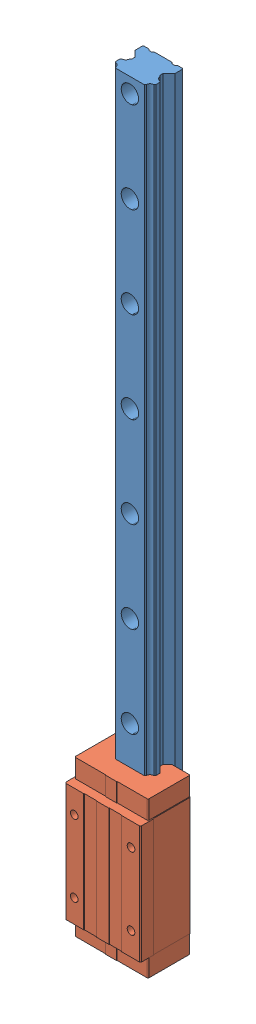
SolidWorks assembly HLH55HA1R1000 E=20.SLDASM, configuration 默认 (file format 13000). Lengths in mm.
Overall size (100 1000 80).
2 component instances, 2 part files, 0 mates.
Components (placement in the parent):
- HLR55R1000 E=20-1: HLR55R1000 E=20.SLDPRT [默认] at origin size (53 1000 44)
- HLH55HA-1: HLH55HA.SLDPRT [默认] at (0 107.4 36) size (100 204.8 67)
